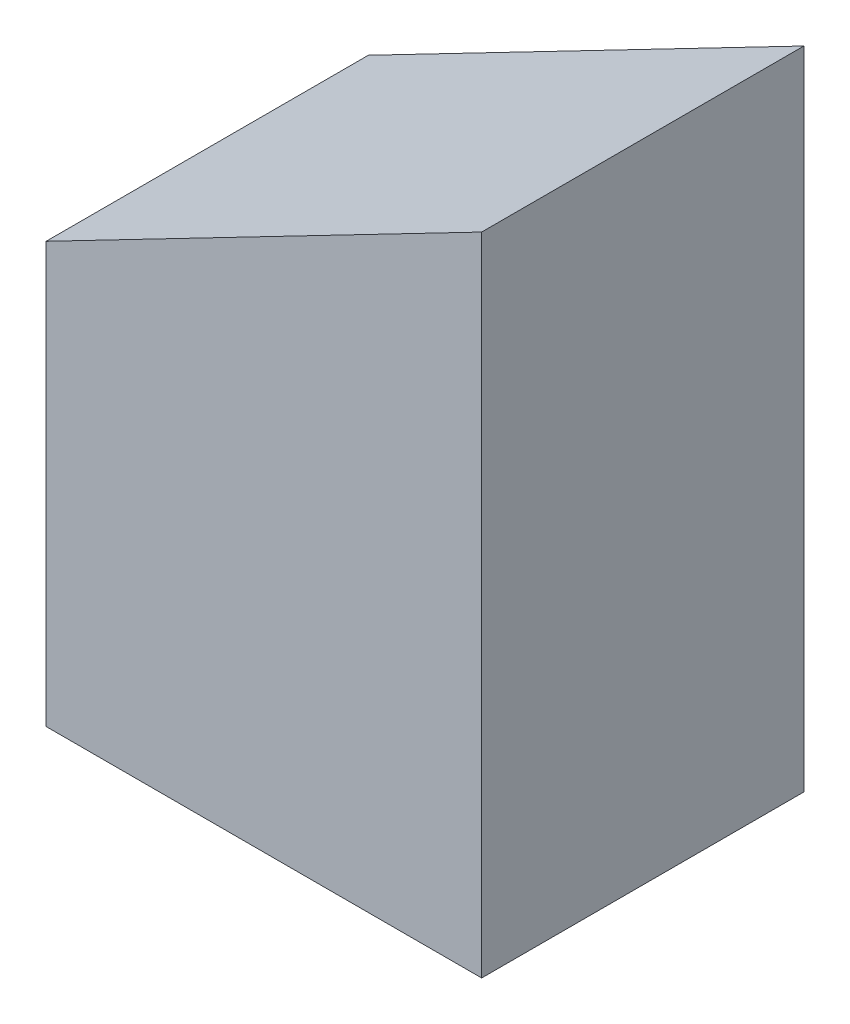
from build123d import *

# Parameters (mm, degrees)
EXTRUDE1_DEPTH = 19.05


with BuildPart() as part:
    # Sketch1 → Extrude1 (new, symmetric)
    with BuildSketch(Plane.XY):
        Polygon((-26.092746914, 0), (25.406095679, 0), (25.406095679, 76.383083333), (-26.092746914, 49.686083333), align=None)
    extrude(amount=EXTRUDE1_DEPTH, both=True)


solid = part.part
